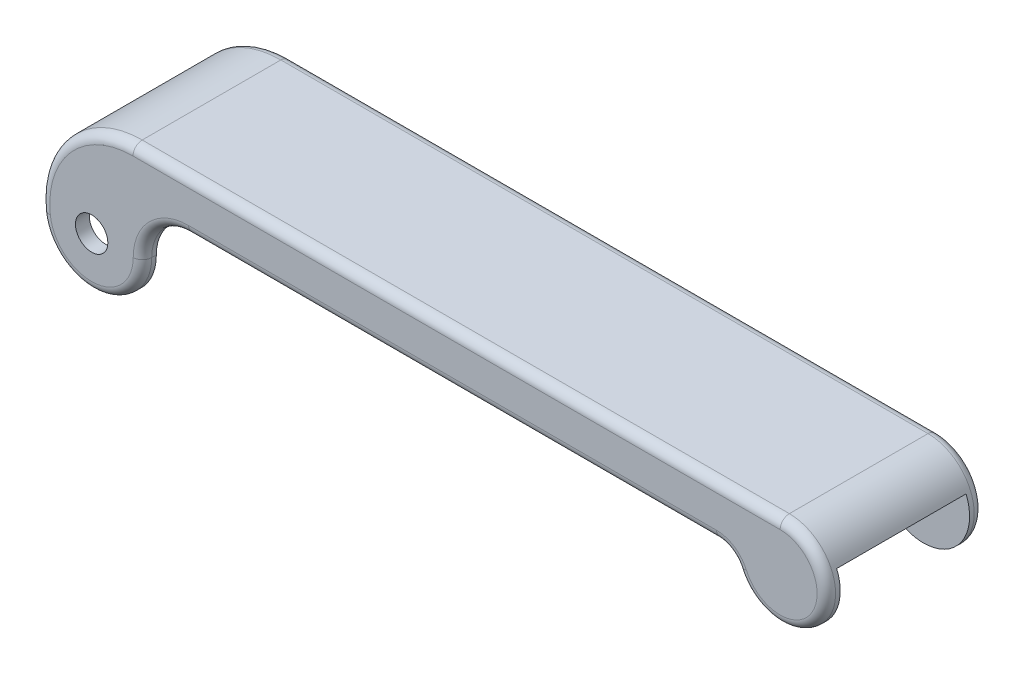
ISO-10303-21;
HEADER;
FILE_DESCRIPTION(('STEP AP214'),'2;1');
FILE_NAME('part.step','',(''),(''),'','','');
FILE_SCHEMA(('AUTOMOTIVE_DESIGN { 1 0 10303 214 1 1 1 1 }'));
ENDSEC;
DATA;
#1=APPLICATION_CONTEXT('core data for automotive mechanical design processes');
#2=APPLICATION_PROTOCOL_DEFINITION('international standard','automotive_design',2000,#1);
#3=PRODUCT_CONTEXT('',#1,'mechanical');
#4=PRODUCT('Part','Part','',(#3));
#5=PRODUCT_RELATED_PRODUCT_CATEGORY('part','',(#4));
#6=PRODUCT_DEFINITION_FORMATION('','',#4);
#7=PRODUCT_DEFINITION_CONTEXT('part definition',#1,'design');
#8=PRODUCT_DEFINITION('design','',#6,#7);
#9=PRODUCT_DEFINITION_SHAPE('','',#8);
#10=(LENGTH_UNIT() NAMED_UNIT(*) SI_UNIT(.MILLI.,.METRE.));
#11=(NAMED_UNIT(*) PLANE_ANGLE_UNIT() SI_UNIT($,.RADIAN.));
#12=(NAMED_UNIT(*) SI_UNIT($,.STERADIAN.) SOLID_ANGLE_UNIT());
#13=UNCERTAINTY_MEASURE_WITH_UNIT(LENGTH_MEASURE(1.E-05),#10,'distance_accuracy_value','');
#14=(GEOMETRIC_REPRESENTATION_CONTEXT(3) GLOBAL_UNCERTAINTY_ASSIGNED_CONTEXT((#13)) GLOBAL_UNIT_ASSIGNED_CONTEXT((#10,
#11,#12)) REPRESENTATION_CONTEXT('',''));
#15=CARTESIAN_POINT('',(0.,0.,0.));
#16=DIRECTION('',(0.,0.,1.));
#17=DIRECTION('',(1.,0.,0.));
#18=AXIS2_PLACEMENT_3D('',#15,#16,#17);
#19=CARTESIAN_POINT('',(-88.2604639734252,-2.69653916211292,3.));
#20=DIRECTION('',(0.,0.,1.));
#21=DIRECTION('',(1.,0.,0.));
#22=AXIS2_PLACEMENT_3D('',#19,#20,#21);
#23=PLANE('',#22);
#24=CARTESIAN_POINT('',(-97.2047358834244,-3.69653916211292,3.));
#25=DIRECTION('',(0.,0.,1.));
#26=DIRECTION('',(1.,0.,0.));
#27=AXIS2_PLACEMENT_3D('',#24,#25,#26);
#28=CIRCLE('',#27,3.50000000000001);
#29=CARTESIAN_POINT('',(-93.7047358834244,-3.69653916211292,3.));
#30=VERTEX_POINT('',#29);
#31=EDGE_CURVE('E603',#30,#30,#28,.T.);
#32=ORIENTED_EDGE('',*,*,#31,.F.);
#33=EDGE_LOOP('',(#32));
#34=FACE_BOUND('',#33,.T.);
#35=CARTESIAN_POINT('',(51.7952641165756,7.30346083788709,3.));
#36=DIRECTION('',(0.,0.,-1.));
#37=DIRECTION('',(-1.,0.,0.));
#38=AXIS2_PLACEMENT_3D('',#35,#36,#37);
#39=CIRCLE('',#38,10.);
#40=CARTESIAN_POINT('',(61.0337649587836,11.1310060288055,3.));
#41=VERTEX_POINT('',#40);
#42=CARTESIAN_POINT('',(42.6301127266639,3.30346083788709,3.));
#43=VERTEX_POINT('',#42);
#44=EDGE_CURVE('E721',#41,#43,#39,.T.);
#45=ORIENTED_EDGE('',*,*,#44,.F.);
#46=DIRECTION('',(-0.923850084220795,-0.382754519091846,0.));
#47=VECTOR('',#46,1.);
#48=CARTESIAN_POINT('',(61.0337649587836,11.1310060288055,3.));
#49=LINE('',#48,#47);
#50=CARTESIAN_POINT('',(58.2622147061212,9.98274247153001,3.));
#51=VERTEX_POINT('',#50);
#52=EDGE_CURVE('E526',#41,#51,#49,.T.);
#53=ORIENTED_EDGE('',*,*,#52,.T.);
#54=CARTESIAN_POINT('',(51.7952641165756,7.30346083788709,3.));
#55=DIRECTION('',(0.,0.,-1.));
#56=DIRECTION('',(-1.,0.,0.));
#57=AXIS2_PLACEMENT_3D('',#54,#55,#56);
#58=CIRCLE('',#57,7.);
#59=CARTESIAN_POINT('',(51.7952641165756,14.3034608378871,3.));
#60=VERTEX_POINT('',#59);
#61=EDGE_CURVE('E808',#60,#51,#58,.T.);
#62=ORIENTED_EDGE('',*,*,#61,.F.);
#63=DIRECTION('',(-1.,0.,0.));
#64=VECTOR('',#63,1.);
#65=CARTESIAN_POINT('',(51.7952641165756,14.3034608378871,3.));
#66=LINE('',#65,#64);
#67=CARTESIAN_POINT('',(-88.2604639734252,14.3034608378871,3.));
#68=VERTEX_POINT('',#67);
#69=EDGE_CURVE('E814',#60,#68,#66,.T.);
#70=ORIENTED_EDGE('',*,*,#69,.T.);
#71=CARTESIAN_POINT('',(-88.2604639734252,-2.69653916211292,3.));
#72=DIRECTION('',(0.,0.,1.));
#73=DIRECTION('',(1.,0.,0.));
#74=AXIS2_PLACEMENT_3D('',#71,#72,#73);
#75=CIRCLE('',#74,17.);
#76=CARTESIAN_POINT('',(-102.982895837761,5.80346083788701,3.));
#77=VERTEX_POINT('',#76);
#78=EDGE_CURVE('E816',#68,#77,#75,.T.);
#79=ORIENTED_EDGE('',*,*,#78,.T.);
#80=DIRECTION('',(0.866025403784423,-0.500000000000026,0.));
#81=VECTOR('',#80,1.);
#82=CARTESIAN_POINT('',(-105.580972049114,7.30346083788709,3.));
#83=LINE('',#82,#81);
#84=CARTESIAN_POINT('',(-105.580972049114,7.30346083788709,3.));
#85=VERTEX_POINT('',#84);
#86=EDGE_CURVE('E818',#85,#77,#83,.T.);
#87=ORIENTED_EDGE('',*,*,#86,.F.);
#88=CARTESIAN_POINT('',(-88.2604639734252,-2.69653916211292,3.));
#89=DIRECTION('',(0.,0.,1.));
#90=DIRECTION('',(1.,0.,0.));
#91=AXIS2_PLACEMENT_3D('',#88,#89,#90);
#92=CIRCLE('',#91,20.);
#93=CARTESIAN_POINT('',(-108.136623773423,-4.91876138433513,3.));
#94=VERTEX_POINT('',#93);
#95=EDGE_CURVE('E717',#85,#94,#92,.T.);
#96=ORIENTED_EDGE('',*,*,#95,.T.);
#97=CARTESIAN_POINT('',(-97.2047358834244,-3.69653916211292,3.));
#98=DIRECTION('',(0.,0.,1.));
#99=DIRECTION('',(1.,0.,0.));
#100=AXIS2_PLACEMENT_3D('',#97,#98,#99);
#101=CIRCLE('',#100,11.);
#102=CARTESIAN_POINT('',(-86.2047358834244,-3.69653916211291,3.));
#103=VERTEX_POINT('',#102);
#104=EDGE_CURVE('E720',#94,#103,#101,.T.);
#105=ORIENTED_EDGE('',*,*,#104,.T.);
#106=CARTESIAN_POINT('',(-76.2047358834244,-3.6965391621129,3.));
#107=DIRECTION('',(0.,0.,-1.));
#108=DIRECTION('',(-1.,0.,0.));
#109=AXIS2_PLACEMENT_3D('',#106,#107,#108);
#110=CIRCLE('',#109,10.);
#111=CARTESIAN_POINT('',(-76.2047358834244,6.3034608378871,3.));
#112=VERTEX_POINT('',#111);
#113=EDGE_CURVE('E708',#103,#112,#110,.T.);
#114=ORIENTED_EDGE('',*,*,#113,.T.);
#115=DIRECTION('',(-1.,0.,0.));
#116=VECTOR('',#115,1.);
#117=CARTESIAN_POINT('',(38.0475370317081,6.30346083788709,3.));
#118=LINE('',#117,#116);
#119=CARTESIAN_POINT('',(38.0475370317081,6.30346083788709,3.));
#120=VERTEX_POINT('',#119);
#121=EDGE_CURVE('E731',#120,#112,#118,.T.);
#122=ORIENTED_EDGE('',*,*,#121,.F.);
#123=CARTESIAN_POINT('',(38.0475370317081,1.30346083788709,3.));
#124=DIRECTION('',(0.,0.,-1.));
#125=DIRECTION('',(-1.,0.,0.));
#126=AXIS2_PLACEMENT_3D('',#123,#124,#125);
#127=CIRCLE('',#126,5.);
#128=EDGE_CURVE('E734',#120,#43,#127,.T.);
#129=ORIENTED_EDGE('',*,*,#128,.T.);
#130=EDGE_LOOP('',(#45,#53,#62,#70,#79,#87,#96,#105,#114,#122,#129));
#131=FACE_BOUND('',#130,.T.);
#132=ADVANCED_FACE('F348',(#34,#131),#23,.T.);
#133=CARTESIAN_POINT('',(-88.2604639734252,-2.69653916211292,3.));
#134=DIRECTION('',(0.,0.,-1.));
#135=DIRECTION('',(-1.,0.,0.));
#136=AXIS2_PLACEMENT_3D('',#133,#134,#135);
#137=CYLINDRICAL_SURFACE('',#136,20.);
#138=DIRECTION('',(0.,0.,-1.));
#139=VECTOR('',#138,1.);
#140=CARTESIAN_POINT('',(-108.136623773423,-4.91876138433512,34.));
#141=LINE('',#140,#139);
#142=CARTESIAN_POINT('',(-108.136623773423,-4.91876138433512,32.));
#143=VERTEX_POINT('',#142);
#144=CARTESIAN_POINT('',(-108.136623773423,-4.91876138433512,31.));
#145=VERTEX_POINT('',#144);
#146=EDGE_CURVE('E515',#143,#145,#141,.T.);
#147=ORIENTED_EDGE('',*,*,#146,.F.);
#148=CARTESIAN_POINT('',(-88.2604639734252,-2.69653916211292,32.));
#149=DIRECTION('',(0.,0.,1.));
#150=DIRECTION('',(1.,0.,0.));
#151=AXIS2_PLACEMENT_3D('',#148,#149,#150);
#152=CIRCLE('',#151,20.);
#153=CARTESIAN_POINT('',(-88.2604639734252,17.3034608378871,32.));
#154=VERTEX_POINT('',#153);
#155=EDGE_CURVE('E656',#143,#154,#152,.F.);
#156=ORIENTED_EDGE('',*,*,#155,.T.);
#157=DIRECTION('',(0.,0.,-1.));
#158=VECTOR('',#157,1.);
#159=CARTESIAN_POINT('',(-88.2604639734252,17.3034608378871,3.));
#160=LINE('',#159,#158);
#161=CARTESIAN_POINT('',(-88.2604639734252,17.3034608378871,2.));
#162=VERTEX_POINT('',#161);
#163=EDGE_CURVE('E738',#154,#162,#160,.T.);
#164=ORIENTED_EDGE('',*,*,#163,.T.);
#165=CARTESIAN_POINT('',(-88.2604639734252,-2.69653916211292,2.));
#166=DIRECTION('',(0.,0.,1.));
#167=DIRECTION('',(1.,0.,0.));
#168=AXIS2_PLACEMENT_3D('',#165,#166,#167);
#169=CIRCLE('',#168,20.);
#170=CARTESIAN_POINT('',(-108.136623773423,-4.91876138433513,2.));
#171=VERTEX_POINT('',#170);
#172=EDGE_CURVE('E654',#162,#171,#169,.T.);
#173=ORIENTED_EDGE('',*,*,#172,.T.);
#174=DIRECTION('',(0.,0.,-1.));
#175=VECTOR('',#174,1.);
#176=CARTESIAN_POINT('',(-108.136623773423,-4.91876138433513,3.));
#177=LINE('',#176,#175);
#178=EDGE_CURVE('E706',#94,#171,#177,.T.);
#179=ORIENTED_EDGE('',*,*,#178,.F.);
#180=ORIENTED_EDGE('',*,*,#95,.F.);
#181=DIRECTION('',(0.,0.,-1.));
#182=VECTOR('',#181,1.);
#183=CARTESIAN_POINT('',(-105.580972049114,7.30346083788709,31.));
#184=LINE('',#183,#182);
#185=CARTESIAN_POINT('',(-105.580972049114,7.30346083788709,31.));
#186=VERTEX_POINT('',#185);
#187=EDGE_CURVE('E533',#186,#85,#184,.T.);
#188=ORIENTED_EDGE('',*,*,#187,.F.);
#189=CARTESIAN_POINT('',(-88.2604639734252,-2.69653916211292,31.));
#190=DIRECTION('',(0.,0.,1.));
#191=DIRECTION('',(1.,0.,0.));
#192=AXIS2_PLACEMENT_3D('',#189,#190,#191);
#193=CIRCLE('',#192,20.);
#194=EDGE_CURVE('E530',#186,#145,#193,.T.);
#195=ORIENTED_EDGE('',*,*,#194,.T.);
#196=EDGE_LOOP('',(#147,#156,#164,#173,#179,#180,#188,#195));
#197=FACE_BOUND('',#196,.T.);
#198=ADVANCED_FACE('F350',(#197),#137,.T.);
#199=CARTESIAN_POINT('',(-97.2047358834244,-3.69653916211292,3.));
#200=DIRECTION('',(0.,0.,-1.));
#201=DIRECTION('',(-1.,0.,0.));
#202=AXIS2_PLACEMENT_3D('',#199,#200,#201);
#203=CYLINDRICAL_SURFACE('',#202,11.);
#204=ORIENTED_EDGE('',*,*,#178,.T.);
#205=CARTESIAN_POINT('',(-97.2047358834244,-3.69653916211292,2.));
#206=DIRECTION('',(0.,0.,1.));
#207=DIRECTION('',(1.,0.,0.));
#208=AXIS2_PLACEMENT_3D('',#205,#206,#207);
#209=CIRCLE('',#208,11.);
#210=CARTESIAN_POINT('',(-86.2047358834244,-3.69653916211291,2.));
#211=VERTEX_POINT('',#210);
#212=EDGE_CURVE('E666',#171,#211,#209,.T.);
#213=ORIENTED_EDGE('',*,*,#212,.T.);
#214=DIRECTION('',(0.,0.,-1.));
#215=VECTOR('',#214,1.);
#216=CARTESIAN_POINT('',(-86.2047358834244,-3.69653916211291,3.));
#217=LINE('',#216,#215);
#218=EDGE_CURVE('E703',#103,#211,#217,.T.);
#219=ORIENTED_EDGE('',*,*,#218,.F.);
#220=ORIENTED_EDGE('',*,*,#104,.F.);
#221=EDGE_LOOP('',(#204,#213,#219,#220));
#222=FACE_BOUND('',#221,.T.);
#223=ADVANCED_FACE('F701',(#222),#203,.T.);
#224=CARTESIAN_POINT('',(-76.2047358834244,-3.6965391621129,3.));
#225=DIRECTION('',(0.,0.,-1.));
#226=DIRECTION('',(-1.,0.,0.));
#227=AXIS2_PLACEMENT_3D('',#224,#225,#226);
#228=CYLINDRICAL_SURFACE('',#227,10.);
#229=ORIENTED_EDGE('',*,*,#218,.T.);
#230=CARTESIAN_POINT('',(-76.2047358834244,-3.6965391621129,2.));
#231=DIRECTION('',(0.,0.,1.));
#232=DIRECTION('',(1.,0.,0.));
#233=AXIS2_PLACEMENT_3D('',#230,#231,#232);
#234=CIRCLE('',#233,10.);
#235=CARTESIAN_POINT('',(-76.2047358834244,6.3034608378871,2.));
#236=VERTEX_POINT('',#235);
#237=EDGE_CURVE('E370',#211,#236,#234,.F.);
#238=ORIENTED_EDGE('',*,*,#237,.T.);
#239=DIRECTION('',(0.,0.,-1.));
#240=VECTOR('',#239,1.);
#241=CARTESIAN_POINT('',(-76.2047358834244,6.3034608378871,3.));
#242=LINE('',#241,#240);
#243=EDGE_CURVE('E709',#112,#236,#242,.T.);
#244=ORIENTED_EDGE('',*,*,#243,.F.);
#245=ORIENTED_EDGE('',*,*,#113,.F.);
#246=EDGE_LOOP('',(#229,#238,#244,#245));
#247=FACE_BOUND('',#246,.T.);
#248=ADVANCED_FACE('F707',(#247),#228,.F.);
#249=CARTESIAN_POINT('',(38.0475370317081,6.30346083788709,3.));
#250=DIRECTION('',(0.,-1.,0.));
#251=DIRECTION('',(1.,0.,0.));
#252=AXIS2_PLACEMENT_3D('',#249,#250,#251);
#253=PLANE('',#252);
#254=ORIENTED_EDGE('',*,*,#243,.T.);
#255=DIRECTION('',(-1.,0.,0.));
#256=VECTOR('',#255,1.);
#257=CARTESIAN_POINT('',(38.0475370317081,6.30346083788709,2.));
#258=LINE('',#257,#256);
#259=CARTESIAN_POINT('',(38.0475370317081,6.30346083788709,2.));
#260=VERTEX_POINT('',#259);
#261=EDGE_CURVE('E356',#236,#260,#258,.F.);
#262=ORIENTED_EDGE('',*,*,#261,.T.);
#263=DIRECTION('',(0.,0.,-1.));
#264=VECTOR('',#263,1.);
#265=CARTESIAN_POINT('',(38.0475370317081,6.30346083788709,3.));
#266=LINE('',#265,#264);
#267=EDGE_CURVE('E713',#120,#260,#266,.T.);
#268=ORIENTED_EDGE('',*,*,#267,.F.);
#269=ORIENTED_EDGE('',*,*,#121,.T.);
#270=EDGE_LOOP('',(#254,#262,#268,#269));
#271=FACE_BOUND('',#270,.T.);
#272=ADVANCED_FACE('F876',(#271),#253,.T.);
#273=CARTESIAN_POINT('',(38.0475370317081,1.30346083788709,3.));
#274=DIRECTION('',(0.,0.,-1.));
#275=DIRECTION('',(-1.,0.,0.));
#276=AXIS2_PLACEMENT_3D('',#273,#274,#275);
#277=CYLINDRICAL_SURFACE('',#276,5.);
#278=ORIENTED_EDGE('',*,*,#267,.T.);
#279=CARTESIAN_POINT('',(38.0475370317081,1.30346083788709,2.));
#280=DIRECTION('',(0.,0.,1.));
#281=DIRECTION('',(1.,0.,0.));
#282=AXIS2_PLACEMENT_3D('',#279,#280,#281);
#283=CIRCLE('',#282,5.);
#284=CARTESIAN_POINT('',(42.6301127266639,3.30346083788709,2.));
#285=VERTEX_POINT('',#284);
#286=EDGE_CURVE('E11',#260,#285,#283,.F.);
#287=ORIENTED_EDGE('',*,*,#286,.T.);
#288=DIRECTION('',(0.,0.,-1.));
#289=VECTOR('',#288,1.);
#290=CARTESIAN_POINT('',(42.6301127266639,3.30346083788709,3.));
#291=LINE('',#290,#289);
#292=EDGE_CURVE('E744',#43,#285,#291,.T.);
#293=ORIENTED_EDGE('',*,*,#292,.F.);
#294=ORIENTED_EDGE('',*,*,#128,.F.);
#295=EDGE_LOOP('',(#278,#287,#293,#294));
#296=FACE_BOUND('',#295,.T.);
#297=ADVANCED_FACE('F749',(#296),#277,.F.);
#298=CARTESIAN_POINT('',(51.7952641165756,7.30346083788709,3.));
#299=DIRECTION('',(0.,0.,-1.));
#300=DIRECTION('',(-1.,0.,0.));
#301=AXIS2_PLACEMENT_3D('',#298,#299,#300);
#302=CYLINDRICAL_SURFACE('',#301,10.);
#303=DIRECTION('',(0.,0.,-1.));
#304=VECTOR('',#303,1.);
#305=CARTESIAN_POINT('',(51.7952641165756,17.3034608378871,3.));
#306=LINE('',#305,#304);
#307=CARTESIAN_POINT('',(51.7952641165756,17.3034608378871,32.));
#308=VERTEX_POINT('',#307);
#309=CARTESIAN_POINT('',(51.7952641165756,17.3034608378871,2.));
#310=VERTEX_POINT('',#309);
#311=EDGE_CURVE('E741',#308,#310,#306,.T.);
#312=ORIENTED_EDGE('',*,*,#311,.F.);
#313=CARTESIAN_POINT('',(51.7952641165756,7.30346083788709,32.));
#314=DIRECTION('',(0.,0.,1.));
#315=DIRECTION('',(1.,0.,0.));
#316=AXIS2_PLACEMENT_3D('',#313,#314,#315);
#317=CIRCLE('',#316,10.);
#318=CARTESIAN_POINT('',(42.6301127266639,3.30346083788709,32.));
#319=VERTEX_POINT('',#318);
#320=EDGE_CURVE('E664',#308,#319,#317,.F.);
#321=ORIENTED_EDGE('',*,*,#320,.T.);
#322=DIRECTION('',(0.,0.,-1.));
#323=VECTOR('',#322,1.);
#324=CARTESIAN_POINT('',(42.6301127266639,3.30346083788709,34.));
#325=LINE('',#324,#323);
#326=CARTESIAN_POINT('',(42.6301127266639,3.30346083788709,31.));
#327=VERTEX_POINT('',#326);
#328=EDGE_CURVE('E554',#319,#327,#325,.T.);
#329=ORIENTED_EDGE('',*,*,#328,.T.);
#330=CARTESIAN_POINT('',(51.7952641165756,7.30346083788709,31.));
#331=DIRECTION('',(0.,0.,1.));
#332=DIRECTION('',(1.,0.,0.));
#333=AXIS2_PLACEMENT_3D('',#330,#331,#332);
#334=CIRCLE('',#333,10.);
#335=CARTESIAN_POINT('',(61.0337649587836,11.1310060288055,31.));
#336=VERTEX_POINT('',#335);
#337=EDGE_CURVE('E536',#327,#336,#334,.T.);
#338=ORIENTED_EDGE('',*,*,#337,.T.);
#339=DIRECTION('',(0.,0.,-1.));
#340=VECTOR('',#339,1.);
#341=CARTESIAN_POINT('',(61.0337649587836,11.1310060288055,31.));
#342=LINE('',#341,#340);
#343=EDGE_CURVE('E791',#336,#41,#342,.T.);
#344=ORIENTED_EDGE('',*,*,#343,.T.);
#345=ORIENTED_EDGE('',*,*,#44,.T.);
#346=ORIENTED_EDGE('',*,*,#292,.T.);
#347=CARTESIAN_POINT('',(51.7952641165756,7.30346083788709,2.));
#348=DIRECTION('',(0.,0.,1.));
#349=DIRECTION('',(1.,0.,0.));
#350=AXIS2_PLACEMENT_3D('',#347,#348,#349);
#351=CIRCLE('',#350,10.);
#352=EDGE_CURVE('E662',#285,#310,#351,.T.);
#353=ORIENTED_EDGE('',*,*,#352,.T.);
#354=EDGE_LOOP('',(#312,#321,#329,#338,#344,#345,#346,#353));
#355=FACE_BOUND('',#354,.T.);
#356=ADVANCED_FACE('F768',(#355),#302,.T.);
#357=CARTESIAN_POINT('',(-88.2604639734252,17.3034608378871,3.));
#358=DIRECTION('',(0.,1.,0.));
#359=DIRECTION('',(-1.,0.,0.));
#360=AXIS2_PLACEMENT_3D('',#357,#358,#359);
#361=PLANE('',#360);
#362=ORIENTED_EDGE('',*,*,#163,.F.);
#363=DIRECTION('',(-1.,0.,0.));
#364=VECTOR('',#363,1.);
#365=CARTESIAN_POINT('',(-88.2604639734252,17.3034608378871,32.));
#366=LINE('',#365,#364);
#367=EDGE_CURVE('E660',#154,#308,#366,.F.);
#368=ORIENTED_EDGE('',*,*,#367,.T.);
#369=ORIENTED_EDGE('',*,*,#311,.T.);
#370=DIRECTION('',(1.,0.,0.));
#371=VECTOR('',#370,1.);
#372=CARTESIAN_POINT('',(-88.2604639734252,17.3034608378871,2.));
#373=LINE('',#372,#371);
#374=EDGE_CURVE('E658',#310,#162,#373,.F.);
#375=ORIENTED_EDGE('',*,*,#374,.T.);
#376=EDGE_LOOP('',(#362,#368,#369,#375));
#377=FACE_BOUND('',#376,.T.);
#378=ADVANCED_FACE('F772',(#377),#361,.T.);
#379=CARTESIAN_POINT('',(-88.2604639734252,-2.69653916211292,0.));
#380=DIRECTION('',(0.,0.,1.));
#381=DIRECTION('',(1.,0.,0.));
#382=AXIS2_PLACEMENT_3D('',#379,#380,#381);
#383=PLANE('',#382);
#384=CARTESIAN_POINT('',(-97.2047358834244,-3.69653916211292,0.));
#385=DIRECTION('',(0.,0.,1.));
#386=DIRECTION('',(1.,0.,0.));
#387=AXIS2_PLACEMENT_3D('',#384,#385,#386);
#388=CIRCLE('',#387,3.50000000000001);
#389=CARTESIAN_POINT('',(-93.7047358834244,-3.69653916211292,0.));
#390=VERTEX_POINT('',#389);
#391=EDGE_CURVE('E609',#390,#390,#388,.T.);
#392=ORIENTED_EDGE('',*,*,#391,.T.);
#393=EDGE_LOOP('',(#392));
#394=FACE_BOUND('',#393,.T.);
#395=CARTESIAN_POINT('',(-76.2047358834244,-3.6965391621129,0.));
#396=DIRECTION('',(0.,0.,1.));
#397=DIRECTION('',(1.,0.,0.));
#398=AXIS2_PLACEMENT_3D('',#395,#396,#397);
#399=CIRCLE('',#398,12.);
#400=CARTESIAN_POINT('',(-76.2047358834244,8.3034608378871,0.));
#401=VERTEX_POINT('',#400);
#402=CARTESIAN_POINT('',(-88.2047358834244,-3.69653916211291,0.));
#403=VERTEX_POINT('',#402);
#404=EDGE_CURVE('E679',#401,#403,#399,.T.);
#405=ORIENTED_EDGE('',*,*,#404,.T.);
#406=CARTESIAN_POINT('',(-97.2047358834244,-3.69653916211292,0.));
#407=DIRECTION('',(0.,0.,1.));
#408=DIRECTION('',(1.,0.,0.));
#409=AXIS2_PLACEMENT_3D('',#406,#407,#408);
#410=CIRCLE('',#409,9.);
#411=CARTESIAN_POINT('',(-106.149007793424,-4.69653916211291,0.));
#412=VERTEX_POINT('',#411);
#413=EDGE_CURVE('E681',#403,#412,#410,.F.);
#414=ORIENTED_EDGE('',*,*,#413,.T.);
#415=CARTESIAN_POINT('',(-88.2604639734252,-2.69653916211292,0.));
#416=DIRECTION('',(0.,0.,1.));
#417=DIRECTION('',(1.,0.,0.));
#418=AXIS2_PLACEMENT_3D('',#415,#416,#417);
#419=CIRCLE('',#418,18.);
#420=CARTESIAN_POINT('',(-88.2604639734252,15.3034608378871,0.));
#421=VERTEX_POINT('',#420);
#422=EDGE_CURVE('E669',#412,#421,#419,.F.);
#423=ORIENTED_EDGE('',*,*,#422,.T.);
#424=DIRECTION('',(1.,0.,0.));
#425=VECTOR('',#424,1.);
#426=CARTESIAN_POINT('',(51.7952641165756,15.3034608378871,0.));
#427=LINE('',#426,#425);
#428=CARTESIAN_POINT('',(51.7952641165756,15.3034608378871,0.));
#429=VERTEX_POINT('',#428);
#430=EDGE_CURVE('E671',#421,#429,#427,.T.);
#431=ORIENTED_EDGE('',*,*,#430,.T.);
#432=CARTESIAN_POINT('',(51.7952641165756,7.30346083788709,0.));
#433=DIRECTION('',(0.,0.,1.));
#434=DIRECTION('',(1.,0.,0.));
#435=AXIS2_PLACEMENT_3D('',#432,#433,#434);
#436=CIRCLE('',#435,8.);
#437=CARTESIAN_POINT('',(44.4631430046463,4.10346083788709,0.));
#438=VERTEX_POINT('',#437);
#439=EDGE_CURVE('E673',#429,#438,#436,.F.);
#440=ORIENTED_EDGE('',*,*,#439,.T.);
#441=CARTESIAN_POINT('',(38.0475370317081,1.30346083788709,0.));
#442=DIRECTION('',(0.,0.,1.));
#443=DIRECTION('',(1.,0.,0.));
#444=AXIS2_PLACEMENT_3D('',#441,#442,#443);
#445=CIRCLE('',#444,7.);
#446=CARTESIAN_POINT('',(38.0475370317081,8.30346083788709,0.));
#447=VERTEX_POINT('',#446);
#448=EDGE_CURVE('E675',#438,#447,#445,.T.);
#449=ORIENTED_EDGE('',*,*,#448,.T.);
#450=DIRECTION('',(-1.,0.,0.));
#451=VECTOR('',#450,1.);
#452=CARTESIAN_POINT('',(-76.2047358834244,8.3034608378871,0.));
#453=LINE('',#452,#451);
#454=EDGE_CURVE('E677',#447,#401,#453,.T.);
#455=ORIENTED_EDGE('',*,*,#454,.T.);
#456=EDGE_LOOP('',(#405,#414,#423,#431,#440,#449,#455));
#457=FACE_BOUND('',#456,.T.);
#458=ADVANCED_FACE('F686',(#394,#457),#383,.F.);
#459=CARTESIAN_POINT('',(-105.580972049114,7.30346083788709,31.));
#460=DIRECTION('',(0.500000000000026,0.866025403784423,0.));
#461=DIRECTION('',(-0.866025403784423,0.500000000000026,0.));
#462=AXIS2_PLACEMENT_3D('',#459,#460,#461);
#463=PLANE('',#462);
#464=ORIENTED_EDGE('',*,*,#86,.T.);
#465=DIRECTION('',(0.,0.,-1.));
#466=VECTOR('',#465,1.);
#467=CARTESIAN_POINT('',(-102.982895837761,5.80346083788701,31.));
#468=LINE('',#467,#466);
#469=CARTESIAN_POINT('',(-102.982895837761,5.80346083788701,31.));
#470=VERTEX_POINT('',#469);
#471=EDGE_CURVE('E828',#470,#77,#468,.T.);
#472=ORIENTED_EDGE('',*,*,#471,.F.);
#473=DIRECTION('',(0.866025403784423,-0.500000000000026,0.));
#474=VECTOR('',#473,1.);
#475=CARTESIAN_POINT('',(-105.580972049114,7.30346083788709,31.));
#476=LINE('',#475,#474);
#477=EDGE_CURVE('E796',#186,#470,#476,.T.);
#478=ORIENTED_EDGE('',*,*,#477,.F.);
#479=ORIENTED_EDGE('',*,*,#187,.T.);
#480=EDGE_LOOP('',(#464,#472,#478,#479));
#481=FACE_BOUND('',#480,.T.);
#482=ADVANCED_FACE('F1055',(#481),#463,.F.);
#483=CARTESIAN_POINT('',(-88.2604639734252,-2.69653916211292,31.));
#484=DIRECTION('',(0.,0.,-1.));
#485=DIRECTION('',(-1.,0.,0.));
#486=AXIS2_PLACEMENT_3D('',#483,#484,#485);
#487=CYLINDRICAL_SURFACE('',#486,17.);
#488=ORIENTED_EDGE('',*,*,#78,.F.);
#489=DIRECTION('',(0.,0.,-1.));
#490=VECTOR('',#489,1.);
#491=CARTESIAN_POINT('',(-88.2604639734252,14.3034608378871,31.));
#492=LINE('',#491,#490);
#493=CARTESIAN_POINT('',(-88.2604639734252,14.3034608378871,31.));
#494=VERTEX_POINT('',#493);
#495=EDGE_CURVE('E1067',#494,#68,#492,.T.);
#496=ORIENTED_EDGE('',*,*,#495,.F.);
#497=CARTESIAN_POINT('',(-88.2604639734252,-2.69653916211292,31.));
#498=DIRECTION('',(0.,0.,1.));
#499=DIRECTION('',(1.,0.,0.));
#500=AXIS2_PLACEMENT_3D('',#497,#498,#499);
#501=CIRCLE('',#500,17.);
#502=EDGE_CURVE('E799',#494,#470,#501,.T.);
#503=ORIENTED_EDGE('',*,*,#502,.T.);
#504=ORIENTED_EDGE('',*,*,#471,.T.);
#505=EDGE_LOOP('',(#488,#496,#503,#504));
#506=FACE_BOUND('',#505,.T.);
#507=ADVANCED_FACE('F1051',(#506),#487,.F.);
#508=CARTESIAN_POINT('',(51.7952641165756,14.3034608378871,31.));
#509=DIRECTION('',(0.,-1.,0.));
#510=DIRECTION('',(1.,0.,0.));
#511=AXIS2_PLACEMENT_3D('',#508,#509,#510);
#512=PLANE('',#511);
#513=ORIENTED_EDGE('',*,*,#69,.F.);
#514=DIRECTION('',(0.,0.,-1.));
#515=VECTOR('',#514,1.);
#516=CARTESIAN_POINT('',(51.7952641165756,14.3034608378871,31.));
#517=LINE('',#516,#515);
#518=CARTESIAN_POINT('',(51.7952641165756,14.3034608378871,31.));
#519=VERTEX_POINT('',#518);
#520=EDGE_CURVE('E798',#519,#60,#517,.T.);
#521=ORIENTED_EDGE('',*,*,#520,.F.);
#522=DIRECTION('',(-1.,0.,0.));
#523=VECTOR('',#522,1.);
#524=CARTESIAN_POINT('',(51.7952641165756,14.3034608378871,31.));
#525=LINE('',#524,#523);
#526=EDGE_CURVE('E821',#519,#494,#525,.T.);
#527=ORIENTED_EDGE('',*,*,#526,.T.);
#528=ORIENTED_EDGE('',*,*,#495,.T.);
#529=EDGE_LOOP('',(#513,#521,#527,#528));
#530=FACE_BOUND('',#529,.T.);
#531=ADVANCED_FACE('F1045',(#530),#512,.T.);
#532=CARTESIAN_POINT('',(51.7952641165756,7.30346083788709,31.));
#533=DIRECTION('',(0.,0.,-1.));
#534=DIRECTION('',(-1.,0.,0.));
#535=AXIS2_PLACEMENT_3D('',#532,#533,#534);
#536=CYLINDRICAL_SURFACE('',#535,7.);
#537=ORIENTED_EDGE('',*,*,#61,.T.);
#538=DIRECTION('',(0.,0.,-1.));
#539=VECTOR('',#538,1.);
#540=CARTESIAN_POINT('',(58.2622147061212,9.98274247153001,31.));
#541=LINE('',#540,#539);
#542=CARTESIAN_POINT('',(58.2622147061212,9.98274247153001,31.));
#543=VERTEX_POINT('',#542);
#544=EDGE_CURVE('E727',#543,#51,#541,.T.);
#545=ORIENTED_EDGE('',*,*,#544,.F.);
#546=CARTESIAN_POINT('',(51.7952641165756,7.30346083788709,31.));
#547=DIRECTION('',(0.,0.,-1.));
#548=DIRECTION('',(-1.,0.,0.));
#549=AXIS2_PLACEMENT_3D('',#546,#547,#548);
#550=CIRCLE('',#549,7.);
#551=EDGE_CURVE('E819',#519,#543,#550,.T.);
#552=ORIENTED_EDGE('',*,*,#551,.F.);
#553=ORIENTED_EDGE('',*,*,#520,.T.);
#554=EDGE_LOOP('',(#537,#545,#552,#553));
#555=FACE_BOUND('',#554,.T.);
#556=ADVANCED_FACE('F1040',(#555),#536,.F.);
#557=CARTESIAN_POINT('',(61.0337649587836,11.1310060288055,31.));
#558=DIRECTION('',(0.382754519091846,-0.923850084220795,0.));
#559=DIRECTION('',(0.923850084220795,0.382754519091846,0.));
#560=AXIS2_PLACEMENT_3D('',#557,#558,#559);
#561=PLANE('',#560);
#562=ORIENTED_EDGE('',*,*,#52,.F.);
#563=ORIENTED_EDGE('',*,*,#343,.F.);
#564=DIRECTION('',(-0.923850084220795,-0.382754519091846,0.));
#565=VECTOR('',#564,1.);
#566=CARTESIAN_POINT('',(61.0337649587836,11.1310060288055,31.));
#567=LINE('',#566,#565);
#568=EDGE_CURVE('E788',#336,#543,#567,.T.);
#569=ORIENTED_EDGE('',*,*,#568,.T.);
#570=ORIENTED_EDGE('',*,*,#544,.T.);
#571=EDGE_LOOP('',(#562,#563,#569,#570));
#572=FACE_BOUND('',#571,.T.);
#573=ADVANCED_FACE('F794',(#572),#561,.T.);
#574=CARTESIAN_POINT('',(51.7952641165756,7.30346083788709,31.));
#575=DIRECTION('',(0.,0.,1.));
#576=DIRECTION('',(1.,0.,0.));
#577=AXIS2_PLACEMENT_3D('',#574,#575,#576);
#578=PLANE('',#577);
#579=CARTESIAN_POINT('',(-97.2047358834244,-3.69653916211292,31.));
#580=DIRECTION('',(0.,0.,1.));
#581=DIRECTION('',(1.,0.,0.));
#582=AXIS2_PLACEMENT_3D('',#579,#580,#581);
#583=CIRCLE('',#582,3.50000000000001);
#584=CARTESIAN_POINT('',(-93.7047358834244,-3.69653916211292,31.));
#585=VERTEX_POINT('',#584);
#586=EDGE_CURVE('E606',#585,#585,#583,.T.);
#587=ORIENTED_EDGE('',*,*,#586,.T.);
#588=EDGE_LOOP('',(#587));
#589=FACE_BOUND('',#588,.T.);
#590=ORIENTED_EDGE('',*,*,#194,.F.);
#591=ORIENTED_EDGE('',*,*,#477,.T.);
#592=ORIENTED_EDGE('',*,*,#502,.F.);
#593=ORIENTED_EDGE('',*,*,#526,.F.);
#594=ORIENTED_EDGE('',*,*,#551,.T.);
#595=ORIENTED_EDGE('',*,*,#568,.F.);
#596=ORIENTED_EDGE('',*,*,#337,.F.);
#597=CARTESIAN_POINT('',(38.0475370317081,1.30346083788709,31.));
#598=DIRECTION('',(0.,0.,-1.));
#599=DIRECTION('',(-1.,0.,0.));
#600=AXIS2_PLACEMENT_3D('',#597,#598,#599);
#601=CIRCLE('',#600,5.);
#602=CARTESIAN_POINT('',(38.0475370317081,6.30346083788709,31.));
#603=VERTEX_POINT('',#602);
#604=EDGE_CURVE('E551',#603,#327,#601,.T.);
#605=ORIENTED_EDGE('',*,*,#604,.F.);
#606=DIRECTION('',(1.,0.,0.));
#607=VECTOR('',#606,1.);
#608=CARTESIAN_POINT('',(-76.2047358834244,6.3034608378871,31.));
#609=LINE('',#608,#607);
#610=CARTESIAN_POINT('',(-76.2047358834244,6.3034608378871,31.));
#611=VERTEX_POINT('',#610);
#612=EDGE_CURVE('E543',#611,#603,#609,.T.);
#613=ORIENTED_EDGE('',*,*,#612,.F.);
#614=CARTESIAN_POINT('',(-76.2047358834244,-3.6965391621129,31.));
#615=DIRECTION('',(0.,0.,-1.));
#616=DIRECTION('',(-1.,0.,0.));
#617=AXIS2_PLACEMENT_3D('',#614,#615,#616);
#618=CIRCLE('',#617,10.);
#619=CARTESIAN_POINT('',(-86.2047358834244,-3.69653916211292,31.));
#620=VERTEX_POINT('',#619);
#621=EDGE_CURVE('E541',#620,#611,#618,.T.);
#622=ORIENTED_EDGE('',*,*,#621,.F.);
#623=CARTESIAN_POINT('',(-97.2047358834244,-3.69653916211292,31.));
#624=DIRECTION('',(0.,0.,1.));
#625=DIRECTION('',(1.,0.,0.));
#626=AXIS2_PLACEMENT_3D('',#623,#624,#625);
#627=CIRCLE('',#626,11.);
#628=EDGE_CURVE('E520',#145,#620,#627,.T.);
#629=ORIENTED_EDGE('',*,*,#628,.F.);
#630=EDGE_LOOP('',(#590,#591,#592,#593,#594,#595,#596,#605,#613,#622,#629));
#631=FACE_BOUND('',#630,.T.);
#632=ADVANCED_FACE('F538',(#589,#631),#578,.F.);
#633=CARTESIAN_POINT('',(-97.2047358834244,-3.69653916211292,34.));
#634=DIRECTION('',(0.,0.,-1.));
#635=DIRECTION('',(-1.,0.,0.));
#636=AXIS2_PLACEMENT_3D('',#633,#634,#635);
#637=CYLINDRICAL_SURFACE('',#636,11.);
#638=DIRECTION('',(0.,0.,-1.));
#639=VECTOR('',#638,1.);
#640=CARTESIAN_POINT('',(-86.2047358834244,-3.69653916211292,34.));
#641=LINE('',#640,#639);
#642=CARTESIAN_POINT('',(-86.2047358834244,-3.69653916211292,32.));
#643=VERTEX_POINT('',#642);
#644=EDGE_CURVE('E527',#643,#620,#641,.T.);
#645=ORIENTED_EDGE('',*,*,#644,.F.);
#646=CARTESIAN_POINT('',(-97.2047358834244,-3.69653916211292,32.));
#647=DIRECTION('',(0.,0.,1.));
#648=DIRECTION('',(1.,0.,0.));
#649=AXIS2_PLACEMENT_3D('',#646,#647,#648);
#650=CIRCLE('',#649,11.);
#651=EDGE_CURVE('E523',#643,#143,#650,.F.);
#652=ORIENTED_EDGE('',*,*,#651,.T.);
#653=ORIENTED_EDGE('',*,*,#146,.T.);
#654=ORIENTED_EDGE('',*,*,#628,.T.);
#655=EDGE_LOOP('',(#645,#652,#653,#654));
#656=FACE_BOUND('',#655,.T.);
#657=ADVANCED_FACE('F518',(#656),#637,.T.);
#658=CARTESIAN_POINT('',(-76.2047358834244,-3.6965391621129,34.));
#659=DIRECTION('',(0.,0.,-1.));
#660=DIRECTION('',(-1.,0.,0.));
#661=AXIS2_PLACEMENT_3D('',#658,#659,#660);
#662=CYLINDRICAL_SURFACE('',#661,10.);
#663=DIRECTION('',(0.,0.,-1.));
#664=VECTOR('',#663,1.);
#665=CARTESIAN_POINT('',(-76.2047358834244,6.3034608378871,34.));
#666=LINE('',#665,#664);
#667=CARTESIAN_POINT('',(-76.2047358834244,6.3034608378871,32.));
#668=VERTEX_POINT('',#667);
#669=EDGE_CURVE('E558',#668,#611,#666,.T.);
#670=ORIENTED_EDGE('',*,*,#669,.F.);
#671=CARTESIAN_POINT('',(-76.2047358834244,-3.6965391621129,32.));
#672=DIRECTION('',(0.,0.,1.));
#673=DIRECTION('',(1.,0.,0.));
#674=AXIS2_PLACEMENT_3D('',#671,#672,#673);
#675=CIRCLE('',#674,10.);
#676=EDGE_CURVE('E651',#668,#643,#675,.T.);
#677=ORIENTED_EDGE('',*,*,#676,.T.);
#678=ORIENTED_EDGE('',*,*,#644,.T.);
#679=ORIENTED_EDGE('',*,*,#621,.T.);
#680=EDGE_LOOP('',(#670,#677,#678,#679));
#681=FACE_BOUND('',#680,.T.);
#682=ADVANCED_FACE('F846',(#681),#662,.F.);
#683=CARTESIAN_POINT('',(-76.2047358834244,6.3034608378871,34.));
#684=DIRECTION('',(0.,1.,0.));
#685=DIRECTION('',(-1.,0.,0.));
#686=AXIS2_PLACEMENT_3D('',#683,#684,#685);
#687=PLANE('',#686);
#688=DIRECTION('',(0.,0.,-1.));
#689=VECTOR('',#688,1.);
#690=CARTESIAN_POINT('',(38.0475370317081,6.30346083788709,34.));
#691=LINE('',#690,#689);
#692=CARTESIAN_POINT('',(38.0475370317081,6.30346083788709,32.));
#693=VERTEX_POINT('',#692);
#694=EDGE_CURVE('E556',#693,#603,#691,.T.);
#695=ORIENTED_EDGE('',*,*,#694,.F.);
#696=DIRECTION('',(1.,0.,0.));
#697=VECTOR('',#696,1.);
#698=CARTESIAN_POINT('',(-76.2047358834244,6.3034608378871,32.));
#699=LINE('',#698,#697);
#700=EDGE_CURVE('E638',#693,#668,#699,.F.);
#701=ORIENTED_EDGE('',*,*,#700,.T.);
#702=ORIENTED_EDGE('',*,*,#669,.T.);
#703=ORIENTED_EDGE('',*,*,#612,.T.);
#704=EDGE_LOOP('',(#695,#701,#702,#703));
#705=FACE_BOUND('',#704,.T.);
#706=ADVANCED_FACE('F848',(#705),#687,.F.);
#707=CARTESIAN_POINT('',(38.0475370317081,1.30346083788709,34.));
#708=DIRECTION('',(0.,0.,-1.));
#709=DIRECTION('',(-1.,0.,0.));
#710=AXIS2_PLACEMENT_3D('',#707,#708,#709);
#711=CYLINDRICAL_SURFACE('',#710,5.);
#712=ORIENTED_EDGE('',*,*,#328,.F.);
#713=CARTESIAN_POINT('',(38.0475370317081,1.30346083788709,32.));
#714=DIRECTION('',(0.,0.,1.));
#715=DIRECTION('',(1.,0.,0.));
#716=AXIS2_PLACEMENT_3D('',#713,#714,#715);
#717=CIRCLE('',#716,5.);
#718=EDGE_CURVE('E645',#319,#693,#717,.T.);
#719=ORIENTED_EDGE('',*,*,#718,.T.);
#720=ORIENTED_EDGE('',*,*,#694,.T.);
#721=ORIENTED_EDGE('',*,*,#604,.T.);
#722=EDGE_LOOP('',(#712,#719,#720,#721));
#723=FACE_BOUND('',#722,.T.);
#724=ADVANCED_FACE('F623',(#723),#711,.F.);
#725=CARTESIAN_POINT('',(51.7952641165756,7.30346083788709,34.));
#726=DIRECTION('',(0.,0.,1.));
#727=DIRECTION('',(1.,0.,0.));
#728=AXIS2_PLACEMENT_3D('',#725,#726,#727);
#729=PLANE('',#728);
#730=CARTESIAN_POINT('',(-97.2047358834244,-3.69653916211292,34.));
#731=DIRECTION('',(0.,0.,1.));
#732=DIRECTION('',(1.,0.,0.));
#733=AXIS2_PLACEMENT_3D('',#730,#731,#732);
#734=CIRCLE('',#733,3.50000000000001);
#735=CARTESIAN_POINT('',(-93.7047358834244,-3.69653916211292,34.));
#736=VERTEX_POINT('',#735);
#737=EDGE_CURVE('E612',#736,#736,#734,.T.);
#738=ORIENTED_EDGE('',*,*,#737,.F.);
#739=EDGE_LOOP('',(#738));
#740=FACE_BOUND('',#739,.T.);
#741=DIRECTION('',(1.,0.,0.));
#742=VECTOR('',#741,1.);
#743=CARTESIAN_POINT('',(38.0475370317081,8.30346083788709,34.));
#744=LINE('',#743,#742);
#745=CARTESIAN_POINT('',(-76.2047358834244,8.3034608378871,34.));
#746=VERTEX_POINT('',#745);
#747=CARTESIAN_POINT('',(38.0475370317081,8.30346083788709,34.));
#748=VERTEX_POINT('',#747);
#749=EDGE_CURVE('E627',#746,#748,#744,.T.);
#750=ORIENTED_EDGE('',*,*,#749,.T.);
#751=CARTESIAN_POINT('',(38.0475370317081,1.30346083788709,34.));
#752=DIRECTION('',(0.,0.,1.));
#753=DIRECTION('',(1.,0.,0.));
#754=AXIS2_PLACEMENT_3D('',#751,#752,#753);
#755=CIRCLE('',#754,7.);
#756=CARTESIAN_POINT('',(44.4631430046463,4.10346083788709,34.));
#757=VERTEX_POINT('',#756);
#758=EDGE_CURVE('E630',#748,#757,#755,.F.);
#759=ORIENTED_EDGE('',*,*,#758,.T.);
#760=CARTESIAN_POINT('',(51.7952641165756,7.30346083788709,34.));
#761=DIRECTION('',(0.,0.,1.));
#762=DIRECTION('',(1.,0.,0.));
#763=AXIS2_PLACEMENT_3D('',#760,#761,#762);
#764=CIRCLE('',#763,8.);
#765=CARTESIAN_POINT('',(51.7952641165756,15.3034608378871,34.));
#766=VERTEX_POINT('',#765);
#767=EDGE_CURVE('E711',#757,#766,#764,.T.);
#768=ORIENTED_EDGE('',*,*,#767,.T.);
#769=DIRECTION('',(-1.,0.,0.));
#770=VECTOR('',#769,1.);
#771=CARTESIAN_POINT('',(51.7952641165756,15.3034608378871,34.));
#772=LINE('',#771,#770);
#773=CARTESIAN_POINT('',(-88.2604639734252,15.3034608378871,34.));
#774=VERTEX_POINT('',#773);
#775=EDGE_CURVE('E779',#766,#774,#772,.T.);
#776=ORIENTED_EDGE('',*,*,#775,.T.);
#777=CARTESIAN_POINT('',(-88.2604639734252,-2.69653916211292,34.));
#778=DIRECTION('',(0.,0.,1.));
#779=DIRECTION('',(1.,0.,0.));
#780=AXIS2_PLACEMENT_3D('',#777,#778,#779);
#781=CIRCLE('',#780,18.);
#782=CARTESIAN_POINT('',(-106.149007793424,-4.6965391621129,34.));
#783=VERTEX_POINT('',#782);
#784=EDGE_CURVE('E834',#774,#783,#781,.T.);
#785=ORIENTED_EDGE('',*,*,#784,.T.);
#786=CARTESIAN_POINT('',(-97.2047358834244,-3.69653916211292,34.));
#787=DIRECTION('',(0.,0.,1.));
#788=DIRECTION('',(1.,0.,0.));
#789=AXIS2_PLACEMENT_3D('',#786,#787,#788);
#790=CIRCLE('',#789,9.);
#791=CARTESIAN_POINT('',(-88.2047358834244,-3.69653916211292,34.));
#792=VERTEX_POINT('',#791);
#793=EDGE_CURVE('E836',#783,#792,#790,.T.);
#794=ORIENTED_EDGE('',*,*,#793,.T.);
#795=CARTESIAN_POINT('',(-76.2047358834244,-3.6965391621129,34.));
#796=DIRECTION('',(0.,0.,1.));
#797=DIRECTION('',(1.,0.,0.));
#798=AXIS2_PLACEMENT_3D('',#795,#796,#797);
#799=CIRCLE('',#798,12.);
#800=EDGE_CURVE('E632',#792,#746,#799,.F.);
#801=ORIENTED_EDGE('',*,*,#800,.T.);
#802=EDGE_LOOP('',(#750,#759,#768,#776,#785,#794,#801));
#803=FACE_BOUND('',#802,.T.);
#804=ADVANCED_FACE('F619',(#740,#803),#729,.T.);
#805=CARTESIAN_POINT('',(-97.2047358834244,-3.69653916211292,32.));
#806=DIRECTION('',(0.,0.,1.));
#807=DIRECTION('',(1.,0.,0.));
#808=AXIS2_PLACEMENT_3D('',#805,#806,#807);
#809=TOROIDAL_SURFACE('',#808,9.,2.);
#810=CARTESIAN_POINT('',(-88.2047358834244,-3.69653916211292,32.));
#811=DIRECTION('',(0.,1.,0.));
#812=DIRECTION('',(-1.,0.,0.));
#813=AXIS2_PLACEMENT_3D('',#810,#811,#812);
#814=CIRCLE('',#813,2.);
#815=EDGE_CURVE('E568',#792,#643,#814,.T.);
#816=ORIENTED_EDGE('',*,*,#815,.F.);
#817=ORIENTED_EDGE('',*,*,#793,.F.);
#818=CARTESIAN_POINT('',(-106.149007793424,-4.6965391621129,32.));
#819=DIRECTION('',(-0.111111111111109,0.993807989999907,0.));
#820=DIRECTION('',(-0.993807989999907,-0.111111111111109,0.));
#821=AXIS2_PLACEMENT_3D('',#818,#819,#820);
#822=CIRCLE('',#821,2.);
#823=EDGE_CURVE('E562',#143,#783,#822,.T.);
#824=ORIENTED_EDGE('',*,*,#823,.F.);
#825=ORIENTED_EDGE('',*,*,#651,.F.);
#826=EDGE_LOOP('',(#816,#817,#824,#825));
#827=FACE_BOUND('',#826,.T.);
#828=ADVANCED_FACE('F622',(#827),#809,.T.);
#829=CARTESIAN_POINT('',(-88.2604639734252,-2.69653916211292,32.));
#830=DIRECTION('',(0.,0.,1.));
#831=DIRECTION('',(1.,0.,0.));
#832=AXIS2_PLACEMENT_3D('',#829,#830,#831);
#833=TOROIDAL_SURFACE('',#832,18.,2.);
#834=ORIENTED_EDGE('',*,*,#823,.T.);
#835=ORIENTED_EDGE('',*,*,#784,.F.);
#836=CARTESIAN_POINT('',(-88.2604639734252,15.3034608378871,32.));
#837=DIRECTION('',(1.,0.,0.));
#838=DIRECTION('',(0.,0.,-1.));
#839=AXIS2_PLACEMENT_3D('',#836,#837,#838);
#840=CIRCLE('',#839,2.);
#841=EDGE_CURVE('E571',#154,#774,#840,.T.);
#842=ORIENTED_EDGE('',*,*,#841,.F.);
#843=ORIENTED_EDGE('',*,*,#155,.F.);
#844=EDGE_LOOP('',(#834,#835,#842,#843));
#845=FACE_BOUND('',#844,.T.);
#846=ADVANCED_FACE('F940',(#845),#833,.T.);
#847=CARTESIAN_POINT('',(-76.2047358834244,-3.6965391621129,32.));
#848=DIRECTION('',(0.,0.,1.));
#849=DIRECTION('',(1.,0.,0.));
#850=AXIS2_PLACEMENT_3D('',#847,#848,#849);
#851=TOROIDAL_SURFACE('',#850,12.,2.);
#852=ORIENTED_EDGE('',*,*,#815,.T.);
#853=ORIENTED_EDGE('',*,*,#676,.F.);
#854=CARTESIAN_POINT('',(-76.2047358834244,8.3034608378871,32.));
#855=DIRECTION('',(1.,0.,0.));
#856=DIRECTION('',(0.,0.,-1.));
#857=AXIS2_PLACEMENT_3D('',#854,#855,#856);
#858=CIRCLE('',#857,2.);
#859=EDGE_CURVE('E574',#746,#668,#858,.T.);
#860=ORIENTED_EDGE('',*,*,#859,.F.);
#861=ORIENTED_EDGE('',*,*,#800,.F.);
#862=EDGE_LOOP('',(#852,#853,#860,#861));
#863=FACE_BOUND('',#862,.T.);
#864=ADVANCED_FACE('F843',(#863),#851,.T.);
#865=CARTESIAN_POINT('',(51.7952641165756,15.3034608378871,32.));
#866=DIRECTION('',(-1.,0.,0.));
#867=DIRECTION('',(0.,-1.,0.));
#868=AXIS2_PLACEMENT_3D('',#865,#866,#867);
#869=CYLINDRICAL_SURFACE('',#868,2.);
#870=ORIENTED_EDGE('',*,*,#841,.T.);
#871=ORIENTED_EDGE('',*,*,#775,.F.);
#872=CARTESIAN_POINT('',(51.7952641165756,15.3034608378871,32.));
#873=DIRECTION('',(1.,0.,0.));
#874=DIRECTION('',(0.,0.,-1.));
#875=AXIS2_PLACEMENT_3D('',#872,#873,#874);
#876=CIRCLE('',#875,2.);
#877=EDGE_CURVE('E577',#308,#766,#876,.T.);
#878=ORIENTED_EDGE('',*,*,#877,.F.);
#879=ORIENTED_EDGE('',*,*,#367,.F.);
#880=EDGE_LOOP('',(#870,#871,#878,#879));
#881=FACE_BOUND('',#880,.T.);
#882=ADVANCED_FACE('F776',(#881),#869,.T.);
#883=CARTESIAN_POINT('',(51.7952641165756,8.30346083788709,32.));
#884=DIRECTION('',(-1.,0.,0.));
#885=DIRECTION('',(0.,-1.,0.));
#886=AXIS2_PLACEMENT_3D('',#883,#884,#885);
#887=CYLINDRICAL_SURFACE('',#886,2.);
#888=ORIENTED_EDGE('',*,*,#859,.T.);
#889=ORIENTED_EDGE('',*,*,#700,.F.);
#890=CARTESIAN_POINT('',(38.0475370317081,8.30346083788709,32.));
#891=DIRECTION('',(1.,0.,0.));
#892=DIRECTION('',(0.,0.,-1.));
#893=AXIS2_PLACEMENT_3D('',#890,#891,#892);
#894=CIRCLE('',#893,2.);
#895=EDGE_CURVE('E580',#748,#693,#894,.T.);
#896=ORIENTED_EDGE('',*,*,#895,.F.);
#897=ORIENTED_EDGE('',*,*,#749,.F.);
#898=EDGE_LOOP('',(#888,#889,#896,#897));
#899=FACE_BOUND('',#898,.T.);
#900=ADVANCED_FACE('F637',(#899),#887,.T.);
#901=CARTESIAN_POINT('',(51.7952641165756,7.30346083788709,32.));
#902=DIRECTION('',(0.,0.,1.));
#903=DIRECTION('',(1.,0.,0.));
#904=AXIS2_PLACEMENT_3D('',#901,#902,#903);
#905=TOROIDAL_SURFACE('',#904,8.,2.);
#906=ORIENTED_EDGE('',*,*,#877,.T.);
#907=ORIENTED_EDGE('',*,*,#767,.F.);
#908=CARTESIAN_POINT('',(44.4631430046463,4.10346083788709,32.));
#909=DIRECTION('',(-0.4,0.916515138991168,0.));
#910=DIRECTION('',(-0.916515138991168,-0.4,0.));
#911=AXIS2_PLACEMENT_3D('',#908,#909,#910);
#912=CIRCLE('',#911,2.);
#913=EDGE_CURVE('E582',#319,#757,#912,.T.);
#914=ORIENTED_EDGE('',*,*,#913,.F.);
#915=ORIENTED_EDGE('',*,*,#320,.F.);
#916=EDGE_LOOP('',(#906,#907,#914,#915));
#917=FACE_BOUND('',#916,.T.);
#918=ADVANCED_FACE('F781',(#917),#905,.T.);
#919=CARTESIAN_POINT('',(38.0475370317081,1.30346083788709,32.));
#920=DIRECTION('',(0.,0.,1.));
#921=DIRECTION('',(1.,0.,0.));
#922=AXIS2_PLACEMENT_3D('',#919,#920,#921);
#923=TOROIDAL_SURFACE('',#922,7.,2.);
#924=ORIENTED_EDGE('',*,*,#895,.T.);
#925=ORIENTED_EDGE('',*,*,#718,.F.);
#926=ORIENTED_EDGE('',*,*,#913,.T.);
#927=ORIENTED_EDGE('',*,*,#758,.F.);
#928=EDGE_LOOP('',(#924,#925,#926,#927));
#929=FACE_BOUND('',#928,.T.);
#930=ADVANCED_FACE('F642',(#929),#923,.T.);
#931=CARTESIAN_POINT('',(51.7952641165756,7.30346083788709,2.));
#932=DIRECTION('',(0.,0.,1.));
#933=DIRECTION('',(1.,0.,0.));
#934=AXIS2_PLACEMENT_3D('',#931,#932,#933);
#935=TOROIDAL_SURFACE('',#934,8.,2.);
#936=CARTESIAN_POINT('',(51.7952641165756,15.3034608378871,2.));
#937=DIRECTION('',(-1.,0.,0.));
#938=DIRECTION('',(0.,0.,1.));
#939=AXIS2_PLACEMENT_3D('',#936,#937,#938);
#940=CIRCLE('',#939,2.);
#941=EDGE_CURVE('E587',#310,#429,#940,.T.);
#942=ORIENTED_EDGE('',*,*,#941,.F.);
#943=ORIENTED_EDGE('',*,*,#352,.F.);
#944=CARTESIAN_POINT('',(44.4631430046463,4.10346083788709,2.));
#945=DIRECTION('',(-0.399999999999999,0.916515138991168,0.));
#946=DIRECTION('',(-0.916515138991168,-0.399999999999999,0.));
#947=AXIS2_PLACEMENT_3D('',#944,#945,#946);
#948=CIRCLE('',#947,2.);
#949=EDGE_CURVE('E584',#438,#285,#948,.T.);
#950=ORIENTED_EDGE('',*,*,#949,.F.);
#951=ORIENTED_EDGE('',*,*,#439,.F.);
#952=EDGE_LOOP('',(#942,#943,#950,#951));
#953=FACE_BOUND('',#952,.T.);
#954=ADVANCED_FACE('F764',(#953),#935,.T.);
#955=CARTESIAN_POINT('',(38.0475370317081,1.30346083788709,2.));
#956=DIRECTION('',(0.,0.,1.));
#957=DIRECTION('',(1.,0.,0.));
#958=AXIS2_PLACEMENT_3D('',#955,#956,#957);
#959=TOROIDAL_SURFACE('',#958,7.,2.);
#960=ORIENTED_EDGE('',*,*,#949,.T.);
#961=ORIENTED_EDGE('',*,*,#286,.F.);
#962=CARTESIAN_POINT('',(38.0475370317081,8.30346083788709,2.));
#963=DIRECTION('',(-1.,0.,0.));
#964=DIRECTION('',(0.,0.,1.));
#965=AXIS2_PLACEMENT_3D('',#962,#963,#964);
#966=CIRCLE('',#965,2.);
#967=EDGE_CURVE('E590',#447,#260,#966,.T.);
#968=ORIENTED_EDGE('',*,*,#967,.F.);
#969=ORIENTED_EDGE('',*,*,#448,.F.);
#970=EDGE_LOOP('',(#960,#961,#968,#969));
#971=FACE_BOUND('',#970,.T.);
#972=ADVANCED_FACE('F754',(#971),#959,.T.);
#973=CARTESIAN_POINT('',(-88.2604639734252,15.3034608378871,2.));
#974=DIRECTION('',(-1.,0.,0.));
#975=DIRECTION('',(0.,-1.,0.));
#976=AXIS2_PLACEMENT_3D('',#973,#974,#975);
#977=CYLINDRICAL_SURFACE('',#976,2.);
#978=ORIENTED_EDGE('',*,*,#941,.T.);
#979=ORIENTED_EDGE('',*,*,#430,.F.);
#980=CARTESIAN_POINT('',(-88.2604639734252,15.3034608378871,2.));
#981=DIRECTION('',(-1.,0.,0.));
#982=DIRECTION('',(0.,0.,1.));
#983=AXIS2_PLACEMENT_3D('',#980,#981,#982);
#984=CIRCLE('',#983,2.);
#985=EDGE_CURVE('E593',#162,#421,#984,.T.);
#986=ORIENTED_EDGE('',*,*,#985,.F.);
#987=ORIENTED_EDGE('',*,*,#374,.F.);
#988=EDGE_LOOP('',(#978,#979,#986,#987));
#989=FACE_BOUND('',#988,.T.);
#990=ADVANCED_FACE('F990',(#989),#977,.T.);
#991=CARTESIAN_POINT('',(-88.2604639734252,8.3034608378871,2.));
#992=DIRECTION('',(1.,0.,0.));
#993=DIRECTION('',(0.,1.,0.));
#994=AXIS2_PLACEMENT_3D('',#991,#992,#993);
#995=CYLINDRICAL_SURFACE('',#994,2.);
#996=ORIENTED_EDGE('',*,*,#967,.T.);
#997=ORIENTED_EDGE('',*,*,#261,.F.);
#998=CARTESIAN_POINT('',(-76.2047358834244,8.3034608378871,2.));
#999=DIRECTION('',(-1.,0.,0.));
#1000=DIRECTION('',(0.,0.,1.));
#1001=AXIS2_PLACEMENT_3D('',#998,#999,#1000);
#1002=CIRCLE('',#1001,2.);
#1003=EDGE_CURVE('E596',#401,#236,#1002,.T.);
#1004=ORIENTED_EDGE('',*,*,#1003,.F.);
#1005=ORIENTED_EDGE('',*,*,#454,.F.);
#1006=EDGE_LOOP('',(#996,#997,#1004,#1005));
#1007=FACE_BOUND('',#1006,.T.);
#1008=ADVANCED_FACE('F759',(#1007),#995,.T.);
#1009=CARTESIAN_POINT('',(-88.2604639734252,-2.69653916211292,2.));
#1010=DIRECTION('',(0.,0.,1.));
#1011=DIRECTION('',(1.,0.,0.));
#1012=AXIS2_PLACEMENT_3D('',#1009,#1010,#1011);
#1013=TOROIDAL_SURFACE('',#1012,18.,2.);
#1014=ORIENTED_EDGE('',*,*,#985,.T.);
#1015=ORIENTED_EDGE('',*,*,#422,.F.);
#1016=CARTESIAN_POINT('',(-106.149007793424,-4.69653916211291,2.));
#1017=DIRECTION('',(0.11111111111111,-0.993807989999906,0.));
#1018=DIRECTION('',(0.993807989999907,0.11111111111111,0.));
#1019=AXIS2_PLACEMENT_3D('',#1016,#1017,#1018);
#1020=CIRCLE('',#1019,2.);
#1021=EDGE_CURVE('E599',#171,#412,#1020,.T.);
#1022=ORIENTED_EDGE('',*,*,#1021,.F.);
#1023=ORIENTED_EDGE('',*,*,#172,.F.);
#1024=EDGE_LOOP('',(#1014,#1015,#1022,#1023));
#1025=FACE_BOUND('',#1024,.T.);
#1026=ADVANCED_FACE('F1004',(#1025),#1013,.T.);
#1027=CARTESIAN_POINT('',(-76.2047358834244,-3.6965391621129,2.));
#1028=DIRECTION('',(0.,0.,1.));
#1029=DIRECTION('',(1.,0.,0.));
#1030=AXIS2_PLACEMENT_3D('',#1027,#1028,#1029);
#1031=TOROIDAL_SURFACE('',#1030,12.,2.);
#1032=ORIENTED_EDGE('',*,*,#1003,.T.);
#1033=ORIENTED_EDGE('',*,*,#237,.F.);
#1034=CARTESIAN_POINT('',(-88.2047358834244,-3.69653916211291,2.));
#1035=DIRECTION('',(0.,-1.,0.));
#1036=DIRECTION('',(1.,0.,0.));
#1037=AXIS2_PLACEMENT_3D('',#1034,#1035,#1036);
#1038=CIRCLE('',#1037,2.);
#1039=EDGE_CURVE('E601',#403,#211,#1038,.T.);
#1040=ORIENTED_EDGE('',*,*,#1039,.F.);
#1041=ORIENTED_EDGE('',*,*,#404,.F.);
#1042=EDGE_LOOP('',(#1032,#1033,#1040,#1041));
#1043=FACE_BOUND('',#1042,.T.);
#1044=ADVANCED_FACE('F696',(#1043),#1031,.T.);
#1045=CARTESIAN_POINT('',(-97.2047358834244,-3.69653916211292,2.));
#1046=DIRECTION('',(0.,0.,1.));
#1047=DIRECTION('',(1.,0.,0.));
#1048=AXIS2_PLACEMENT_3D('',#1045,#1046,#1047);
#1049=TOROIDAL_SURFACE('',#1048,9.,2.);
#1050=ORIENTED_EDGE('',*,*,#1021,.T.);
#1051=ORIENTED_EDGE('',*,*,#413,.F.);
#1052=ORIENTED_EDGE('',*,*,#1039,.T.);
#1053=ORIENTED_EDGE('',*,*,#212,.F.);
#1054=EDGE_LOOP('',(#1050,#1051,#1052,#1053));
#1055=FACE_BOUND('',#1054,.T.);
#1056=ADVANCED_FACE('F692',(#1055),#1049,.T.);
#1057=CARTESIAN_POINT('',(-97.2047358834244,-3.69653916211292,0.));
#1058=DIRECTION('',(0.,0.,1.));
#1059=DIRECTION('',(1.,0.,0.));
#1060=AXIS2_PLACEMENT_3D('',#1057,#1058,#1059);
#1061=CYLINDRICAL_SURFACE('',#1060,3.50000000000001);
#1062=ORIENTED_EDGE('',*,*,#737,.T.);
#1063=EDGE_LOOP('',(#1062));
#1064=FACE_BOUND('',#1063,.T.);
#1065=ORIENTED_EDGE('',*,*,#586,.F.);
#1066=EDGE_LOOP('',(#1065));
#1067=FACE_BOUND('',#1066,.T.);
#1068=ADVANCED_FACE('F616',(#1064,#1067),#1061,.F.);
#1069=ORIENTED_EDGE('',*,*,#31,.T.);
#1070=EDGE_LOOP('',(#1069));
#1071=FACE_BOUND('',#1070,.T.);
#1072=ORIENTED_EDGE('',*,*,#391,.F.);
#1073=EDGE_LOOP('',(#1072));
#1074=FACE_BOUND('',#1073,.T.);
#1075=ADVANCED_FACE('F1028',(#1071,#1074),#1061,.F.);
#1076=CLOSED_SHELL('',(#132,#198,#223,#248,#272,#297,#356,#378,#458,#482,#507,#531,#556,#573,
#632,#657,#682,#706,#724,#804,#828,#846,#864,#882,#900,#918,#930,#954,#972,#990,#1008,#1026,
#1044,#1056,#1068,#1075));
#1077=MANIFOLD_SOLID_BREP('B2',#1076);
#1078=ADVANCED_BREP_SHAPE_REPRESENTATION('',(#18,#1077),#14);
#1079=SHAPE_DEFINITION_REPRESENTATION(#9,#1078);
ENDSEC;
END-ISO-10303-21;
